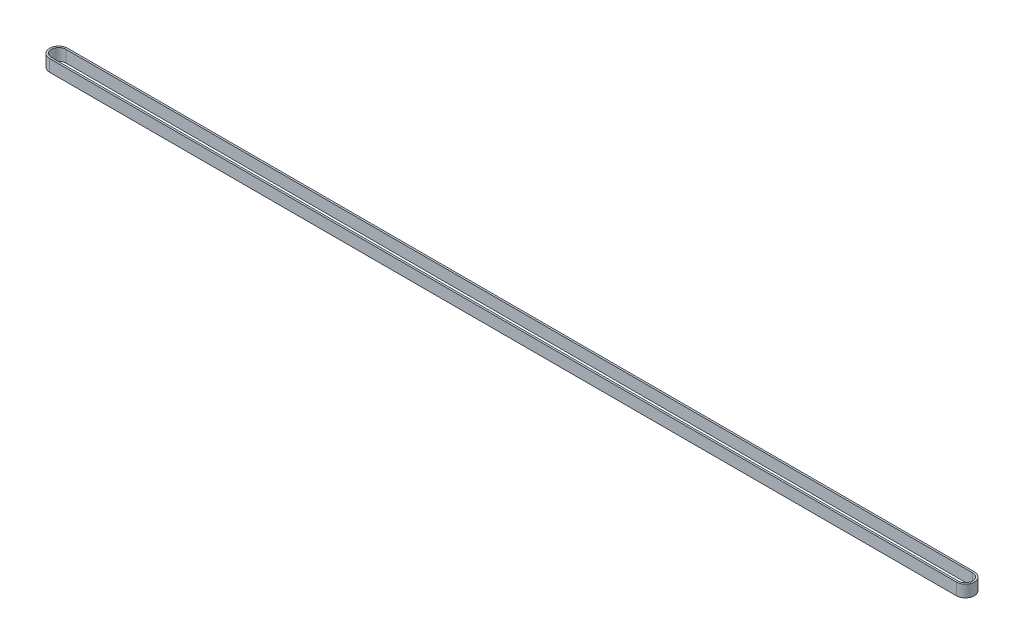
ISO-10303-21;
HEADER;
FILE_DESCRIPTION(('STEP AP214'),'2;1');
FILE_NAME('part.step','',(''),(''),'','','');
FILE_SCHEMA(('AUTOMOTIVE_DESIGN { 1 0 10303 214 1 1 1 1 }'));
ENDSEC;
DATA;
#1=APPLICATION_CONTEXT('core data for automotive mechanical design processes');
#2=APPLICATION_PROTOCOL_DEFINITION('international standard','automotive_design',2000,#1);
#3=PRODUCT_CONTEXT('',#1,'mechanical');
#4=PRODUCT('Part','Part','',(#3));
#5=PRODUCT_RELATED_PRODUCT_CATEGORY('part','',(#4));
#6=PRODUCT_DEFINITION_FORMATION('','',#4);
#7=PRODUCT_DEFINITION_CONTEXT('part definition',#1,'design');
#8=PRODUCT_DEFINITION('design','',#6,#7);
#9=PRODUCT_DEFINITION_SHAPE('','',#8);
#10=(LENGTH_UNIT() NAMED_UNIT(*) SI_UNIT(.MILLI.,.METRE.));
#11=(NAMED_UNIT(*) PLANE_ANGLE_UNIT() SI_UNIT($,.RADIAN.));
#12=(NAMED_UNIT(*) SI_UNIT($,.STERADIAN.) SOLID_ANGLE_UNIT());
#13=UNCERTAINTY_MEASURE_WITH_UNIT(LENGTH_MEASURE(1.E-05),#10,'distance_accuracy_value','');
#14=(GEOMETRIC_REPRESENTATION_CONTEXT(3) GLOBAL_UNCERTAINTY_ASSIGNED_CONTEXT((#13)) GLOBAL_UNIT_ASSIGNED_CONTEXT((#10,
#11,#12)) REPRESENTATION_CONTEXT('',''));
#15=CARTESIAN_POINT('',(0.,0.,0.));
#16=DIRECTION('',(0.,0.,1.));
#17=DIRECTION('',(1.,0.,0.));
#18=AXIS2_PLACEMENT_3D('',#15,#16,#17);
#19=CARTESIAN_POINT('',(758.8,5.,0.));
#20=DIRECTION('',(0.,1.,0.));
#21=DIRECTION('',(0.,0.,1.));
#22=AXIS2_PLACEMENT_3D('',#19,#20,#21);
#23=PLANE('',#22);
#24=CARTESIAN_POINT('',(758.8,5.,0.));
#25=DIRECTION('',(0.,1.,0.));
#26=DIRECTION('',(0.,0.,1.));
#27=AXIS2_PLACEMENT_3D('',#24,#25,#26);
#28=CIRCLE('',#27,7.5);
#29=CARTESIAN_POINT('',(758.8,5.,7.5));
#30=VERTEX_POINT('',#29);
#31=CARTESIAN_POINT('',(758.8,5.,-7.5));
#32=VERTEX_POINT('',#31);
#33=EDGE_CURVE('E135',#30,#32,#28,.T.);
#34=ORIENTED_EDGE('',*,*,#33,.T.);
#35=DIRECTION('',(-1.,0.,0.));
#36=VECTOR('',#35,1.);
#37=CARTESIAN_POINT('',(758.8,5.,-7.5));
#38=LINE('',#37,#36);
#39=CARTESIAN_POINT('',(0.,5.,-7.5));
#40=VERTEX_POINT('',#39);
#41=EDGE_CURVE('E138',#32,#40,#38,.T.);
#42=ORIENTED_EDGE('',*,*,#41,.T.);
#43=CARTESIAN_POINT('',(0.,5.,0.));
#44=DIRECTION('',(0.,1.,0.));
#45=DIRECTION('',(0.,0.,1.));
#46=AXIS2_PLACEMENT_3D('',#43,#44,#45);
#47=CIRCLE('',#46,7.5);
#48=CARTESIAN_POINT('',(0.,5.,7.5));
#49=VERTEX_POINT('',#48);
#50=EDGE_CURVE('E141',#40,#49,#47,.T.);
#51=ORIENTED_EDGE('',*,*,#50,.T.);
#52=DIRECTION('',(1.,0.,0.));
#53=VECTOR('',#52,1.);
#54=CARTESIAN_POINT('',(758.8,5.,7.5));
#55=LINE('',#54,#53);
#56=EDGE_CURVE('E143',#49,#30,#55,.T.);
#57=ORIENTED_EDGE('',*,*,#56,.T.);
#58=EDGE_LOOP('',(#34,#42,#51,#57));
#59=FACE_BOUND('',#58,.T.);
#60=DIRECTION('',(-1.,0.,0.));
#61=VECTOR('',#60,1.);
#62=CARTESIAN_POINT('',(0.,5.,-6.));
#63=LINE('',#62,#61);
#64=CARTESIAN_POINT('',(758.8,5.,-6.));
#65=VERTEX_POINT('',#64);
#66=CARTESIAN_POINT('',(0.,5.,-6.));
#67=VERTEX_POINT('',#66);
#68=EDGE_CURVE('E107',#65,#67,#63,.T.);
#69=ORIENTED_EDGE('',*,*,#68,.F.);
#70=CARTESIAN_POINT('',(758.8,5.,0.));
#71=DIRECTION('',(0.,1.,0.));
#72=DIRECTION('',(0.,0.,1.));
#73=AXIS2_PLACEMENT_3D('',#70,#71,#72);
#74=CIRCLE('',#73,6.);
#75=CARTESIAN_POINT('',(758.8,5.,6.));
#76=VERTEX_POINT('',#75);
#77=EDGE_CURVE('E99',#76,#65,#74,.T.);
#78=ORIENTED_EDGE('',*,*,#77,.F.);
#79=DIRECTION('',(1.,0.,0.));
#80=VECTOR('',#79,1.);
#81=CARTESIAN_POINT('',(758.8,5.,6.));
#82=LINE('',#81,#80);
#83=CARTESIAN_POINT('',(0.,5.,6.));
#84=VERTEX_POINT('',#83);
#85=EDGE_CURVE('E121',#84,#76,#82,.T.);
#86=ORIENTED_EDGE('',*,*,#85,.F.);
#87=CARTESIAN_POINT('',(0.,5.,0.));
#88=DIRECTION('',(0.,1.,0.));
#89=DIRECTION('',(0.,0.,1.));
#90=AXIS2_PLACEMENT_3D('',#87,#88,#89);
#91=CIRCLE('',#90,6.);
#92=EDGE_CURVE('E119',#67,#84,#91,.T.);
#93=ORIENTED_EDGE('',*,*,#92,.F.);
#94=EDGE_LOOP('',(#69,#78,#86,#93));
#95=FACE_BOUND('',#94,.T.);
#96=ADVANCED_FACE('F34',(#59,#95),#23,.T.);
#97=CARTESIAN_POINT('',(758.8,-5.,0.));
#98=DIRECTION('',(0.,1.,0.));
#99=DIRECTION('',(0.,0.,1.));
#100=AXIS2_PLACEMENT_3D('',#97,#98,#99);
#101=PLANE('',#100);
#102=CARTESIAN_POINT('',(758.8,-5.,0.));
#103=DIRECTION('',(0.,1.,0.));
#104=DIRECTION('',(0.,0.,1.));
#105=AXIS2_PLACEMENT_3D('',#102,#103,#104);
#106=CIRCLE('',#105,7.5);
#107=CARTESIAN_POINT('',(758.8,-5.,7.5));
#108=VERTEX_POINT('',#107);
#109=CARTESIAN_POINT('',(758.8,-5.,-7.5));
#110=VERTEX_POINT('',#109);
#111=EDGE_CURVE('E115',#108,#110,#106,.T.);
#112=ORIENTED_EDGE('',*,*,#111,.F.);
#113=DIRECTION('',(1.,0.,0.));
#114=VECTOR('',#113,1.);
#115=CARTESIAN_POINT('',(758.8,-5.,7.5));
#116=LINE('',#115,#114);
#117=CARTESIAN_POINT('',(0.,-5.,7.5));
#118=VERTEX_POINT('',#117);
#119=EDGE_CURVE('E139',#118,#108,#116,.T.);
#120=ORIENTED_EDGE('',*,*,#119,.F.);
#121=CARTESIAN_POINT('',(0.,-5.,0.));
#122=DIRECTION('',(0.,1.,0.));
#123=DIRECTION('',(0.,0.,1.));
#124=AXIS2_PLACEMENT_3D('',#121,#122,#123);
#125=CIRCLE('',#124,7.5);
#126=CARTESIAN_POINT('',(0.,-5.,-7.5));
#127=VERTEX_POINT('',#126);
#128=EDGE_CURVE('E150',#127,#118,#125,.T.);
#129=ORIENTED_EDGE('',*,*,#128,.F.);
#130=DIRECTION('',(-1.,0.,0.));
#131=VECTOR('',#130,1.);
#132=CARTESIAN_POINT('',(758.8,-5.,-7.5));
#133=LINE('',#132,#131);
#134=EDGE_CURVE('E148',#110,#127,#133,.T.);
#135=ORIENTED_EDGE('',*,*,#134,.F.);
#136=EDGE_LOOP('',(#112,#120,#129,#135));
#137=FACE_BOUND('',#136,.T.);
#138=CARTESIAN_POINT('',(758.8,-5.,0.));
#139=DIRECTION('',(0.,1.,0.));
#140=DIRECTION('',(0.,0.,1.));
#141=AXIS2_PLACEMENT_3D('',#138,#139,#140);
#142=CIRCLE('',#141,6.);
#143=CARTESIAN_POINT('',(758.8,-5.,6.));
#144=VERTEX_POINT('',#143);
#145=CARTESIAN_POINT('',(758.8,-5.,-6.));
#146=VERTEX_POINT('',#145);
#147=EDGE_CURVE('E57',#144,#146,#142,.T.);
#148=ORIENTED_EDGE('',*,*,#147,.T.);
#149=DIRECTION('',(-1.,0.,0.));
#150=VECTOR('',#149,1.);
#151=CARTESIAN_POINT('',(0.,-5.,-6.));
#152=LINE('',#151,#150);
#153=CARTESIAN_POINT('',(0.,-5.,-6.));
#154=VERTEX_POINT('',#153);
#155=EDGE_CURVE('E114',#146,#154,#152,.T.);
#156=ORIENTED_EDGE('',*,*,#155,.T.);
#157=CARTESIAN_POINT('',(0.,-5.,0.));
#158=DIRECTION('',(0.,1.,0.));
#159=DIRECTION('',(0.,0.,1.));
#160=AXIS2_PLACEMENT_3D('',#157,#158,#159);
#161=CIRCLE('',#160,6.);
#162=CARTESIAN_POINT('',(0.,-5.,6.));
#163=VERTEX_POINT('',#162);
#164=EDGE_CURVE('E127',#154,#163,#161,.T.);
#165=ORIENTED_EDGE('',*,*,#164,.T.);
#166=DIRECTION('',(1.,0.,0.));
#167=VECTOR('',#166,1.);
#168=CARTESIAN_POINT('',(758.8,-5.,6.));
#169=LINE('',#168,#167);
#170=EDGE_CURVE('E108',#163,#144,#169,.T.);
#171=ORIENTED_EDGE('',*,*,#170,.T.);
#172=EDGE_LOOP('',(#148,#156,#165,#171));
#173=FACE_BOUND('',#172,.T.);
#174=ADVANCED_FACE('F168',(#137,#173),#101,.F.);
#175=CARTESIAN_POINT('',(758.8,5.,0.));
#176=DIRECTION('',(0.,-1.,0.));
#177=DIRECTION('',(0.,0.,-1.));
#178=AXIS2_PLACEMENT_3D('',#175,#176,#177);
#179=CYLINDRICAL_SURFACE('',#178,7.5);
#180=ORIENTED_EDGE('',*,*,#111,.T.);
#181=DIRECTION('',(0.,-1.,0.));
#182=VECTOR('',#181,1.);
#183=CARTESIAN_POINT('',(758.8,5.,-7.5));
#184=LINE('',#183,#182);
#185=EDGE_CURVE('E11',#32,#110,#184,.T.);
#186=ORIENTED_EDGE('',*,*,#185,.F.);
#187=ORIENTED_EDGE('',*,*,#33,.F.);
#188=DIRECTION('',(0.,-1.,0.));
#189=VECTOR('',#188,1.);
#190=CARTESIAN_POINT('',(758.8,5.,7.5));
#191=LINE('',#190,#189);
#192=EDGE_CURVE('E145',#30,#108,#191,.T.);
#193=ORIENTED_EDGE('',*,*,#192,.T.);
#194=EDGE_LOOP('',(#180,#186,#187,#193));
#195=FACE_BOUND('',#194,.T.);
#196=ADVANCED_FACE('F36',(#195),#179,.T.);
#197=CARTESIAN_POINT('',(758.8,5.,-7.5));
#198=DIRECTION('',(0.,0.,1.));
#199=DIRECTION('',(1.,0.,0.));
#200=AXIS2_PLACEMENT_3D('',#197,#198,#199);
#201=PLANE('',#200);
#202=ORIENTED_EDGE('',*,*,#134,.T.);
#203=DIRECTION('',(0.,-1.,0.));
#204=VECTOR('',#203,1.);
#205=CARTESIAN_POINT('',(0.,5.,-7.5));
#206=LINE('',#205,#204);
#207=EDGE_CURVE('E42',#40,#127,#206,.T.);
#208=ORIENTED_EDGE('',*,*,#207,.F.);
#209=ORIENTED_EDGE('',*,*,#41,.F.);
#210=ORIENTED_EDGE('',*,*,#185,.T.);
#211=EDGE_LOOP('',(#202,#208,#209,#210));
#212=FACE_BOUND('',#211,.T.);
#213=ADVANCED_FACE('F178',(#212),#201,.F.);
#214=CARTESIAN_POINT('',(0.,5.,0.));
#215=DIRECTION('',(0.,-1.,0.));
#216=DIRECTION('',(0.,0.,-1.));
#217=AXIS2_PLACEMENT_3D('',#214,#215,#216);
#218=CYLINDRICAL_SURFACE('',#217,7.5);
#219=ORIENTED_EDGE('',*,*,#128,.T.);
#220=DIRECTION('',(0.,-1.,0.));
#221=VECTOR('',#220,1.);
#222=CARTESIAN_POINT('',(0.,5.,7.5));
#223=LINE('',#222,#221);
#224=EDGE_CURVE('E155',#49,#118,#223,.T.);
#225=ORIENTED_EDGE('',*,*,#224,.F.);
#226=ORIENTED_EDGE('',*,*,#50,.F.);
#227=ORIENTED_EDGE('',*,*,#207,.T.);
#228=EDGE_LOOP('',(#219,#225,#226,#227));
#229=FACE_BOUND('',#228,.T.);
#230=ADVANCED_FACE('F162',(#229),#218,.T.);
#231=CARTESIAN_POINT('',(758.8,5.,7.5));
#232=DIRECTION('',(0.,0.,-1.));
#233=DIRECTION('',(-1.,0.,0.));
#234=AXIS2_PLACEMENT_3D('',#231,#232,#233);
#235=PLANE('',#234);
#236=ORIENTED_EDGE('',*,*,#119,.T.);
#237=ORIENTED_EDGE('',*,*,#192,.F.);
#238=ORIENTED_EDGE('',*,*,#56,.F.);
#239=ORIENTED_EDGE('',*,*,#224,.T.);
#240=EDGE_LOOP('',(#236,#237,#238,#239));
#241=FACE_BOUND('',#240,.T.);
#242=ADVANCED_FACE('F172',(#241),#235,.F.);
#243=CARTESIAN_POINT('',(758.8,5.,0.));
#244=DIRECTION('',(0.,-1.,0.));
#245=DIRECTION('',(0.,0.,-1.));
#246=AXIS2_PLACEMENT_3D('',#243,#244,#245);
#247=CYLINDRICAL_SURFACE('',#246,6.);
#248=ORIENTED_EDGE('',*,*,#147,.F.);
#249=DIRECTION('',(0.,-1.,0.));
#250=VECTOR('',#249,1.);
#251=CARTESIAN_POINT('',(758.8,5.,6.));
#252=LINE('',#251,#250);
#253=EDGE_CURVE('E103',#76,#144,#252,.T.);
#254=ORIENTED_EDGE('',*,*,#253,.F.);
#255=ORIENTED_EDGE('',*,*,#77,.T.);
#256=DIRECTION('',(0.,-1.,0.));
#257=VECTOR('',#256,1.);
#258=CARTESIAN_POINT('',(758.8,5.,-6.));
#259=LINE('',#258,#257);
#260=EDGE_CURVE('E102',#65,#146,#259,.T.);
#261=ORIENTED_EDGE('',*,*,#260,.T.);
#262=EDGE_LOOP('',(#248,#254,#255,#261));
#263=FACE_BOUND('',#262,.T.);
#264=ADVANCED_FACE('F101',(#263),#247,.F.);
#265=CARTESIAN_POINT('',(0.,5.,-6.));
#266=DIRECTION('',(0.,0.,1.));
#267=DIRECTION('',(1.,0.,0.));
#268=AXIS2_PLACEMENT_3D('',#265,#266,#267);
#269=PLANE('',#268);
#270=ORIENTED_EDGE('',*,*,#155,.F.);
#271=ORIENTED_EDGE('',*,*,#260,.F.);
#272=ORIENTED_EDGE('',*,*,#68,.T.);
#273=DIRECTION('',(0.,-1.,0.));
#274=VECTOR('',#273,1.);
#275=CARTESIAN_POINT('',(0.,5.,-6.));
#276=LINE('',#275,#274);
#277=EDGE_CURVE('E116',#67,#154,#276,.T.);
#278=ORIENTED_EDGE('',*,*,#277,.T.);
#279=EDGE_LOOP('',(#270,#271,#272,#278));
#280=FACE_BOUND('',#279,.T.);
#281=ADVANCED_FACE('F111',(#280),#269,.T.);
#282=CARTESIAN_POINT('',(0.,5.,0.));
#283=DIRECTION('',(0.,-1.,0.));
#284=DIRECTION('',(0.,0.,-1.));
#285=AXIS2_PLACEMENT_3D('',#282,#283,#284);
#286=CYLINDRICAL_SURFACE('',#285,6.);
#287=ORIENTED_EDGE('',*,*,#164,.F.);
#288=ORIENTED_EDGE('',*,*,#277,.F.);
#289=ORIENTED_EDGE('',*,*,#92,.T.);
#290=DIRECTION('',(0.,-1.,0.));
#291=VECTOR('',#290,1.);
#292=CARTESIAN_POINT('',(0.,5.,6.));
#293=LINE('',#292,#291);
#294=EDGE_CURVE('E49',#84,#163,#293,.T.);
#295=ORIENTED_EDGE('',*,*,#294,.T.);
#296=EDGE_LOOP('',(#287,#288,#289,#295));
#297=FACE_BOUND('',#296,.T.);
#298=ADVANCED_FACE('F201',(#297),#286,.F.);
#299=CARTESIAN_POINT('',(758.8,5.,6.));
#300=DIRECTION('',(0.,0.,-1.));
#301=DIRECTION('',(-1.,0.,0.));
#302=AXIS2_PLACEMENT_3D('',#299,#300,#301);
#303=PLANE('',#302);
#304=ORIENTED_EDGE('',*,*,#170,.F.);
#305=ORIENTED_EDGE('',*,*,#294,.F.);
#306=ORIENTED_EDGE('',*,*,#85,.T.);
#307=ORIENTED_EDGE('',*,*,#253,.T.);
#308=EDGE_LOOP('',(#304,#305,#306,#307));
#309=FACE_BOUND('',#308,.T.);
#310=ADVANCED_FACE('F205',(#309),#303,.T.);
#311=CLOSED_SHELL('',(#96,#174,#196,#213,#230,#242,#264,#281,#298,#310));
#312=MANIFOLD_SOLID_BREP('B2',#311);
#313=ADVANCED_BREP_SHAPE_REPRESENTATION('',(#18,#312),#14);
#314=SHAPE_DEFINITION_REPRESENTATION(#9,#313);
ENDSEC;
END-ISO-10303-21;
